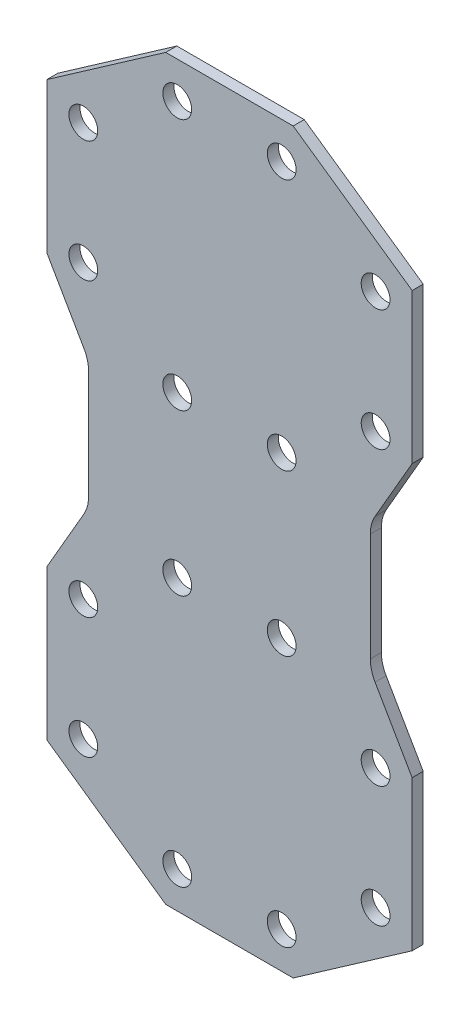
from build123d import *

# Parameters (mm, degrees)
MAIN_PLATE_DEPTH   = 31.75
SKETCH5_R          = 41.275
CUT_EXTRUDE1_DEPTH = 31.75


with BuildPart() as part:
    # Sketch3 → Main Plate (new body)
    with BuildSketch(Plane(origin=(0, 0, 0), x_dir=(0, 1, 0), z_dir=(0, 0, 1))):
        with BuildLine():
            Line((201.663107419, -523.855268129), (-228.234235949, -523.855268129))
            Line((-228.234235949, -523.855268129), (-466.324268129, -182.70492307))
            Line((-466.324268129, -182.70492307), (-466.324268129, 182.70492307))
            Line((-466.324268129, 182.70492307), (-228.234235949, 523.855268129))
            Line((-228.234235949, 523.855268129), (201.663107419, 523.855268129))
            Line((201.663107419, 523.855268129), (385.932842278, 417.467087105))
            ThreePointArc((385.932842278, 417.467087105), (410.436827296, 407.317204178), (436.732842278, 403.855268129))
            Line((436.732842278, 403.855268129), (746.653157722, 403.855268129))
            ThreePointArc((746.653157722, 403.855268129), (772.949172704, 407.317204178), (797.453157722, 417.467087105))
            Line((797.453157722, 417.467087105), (981.722892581, 523.855268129))
            Line((981.722892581, 523.855268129), (1411.620235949, 523.855268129))
            Line((1411.620235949, 523.855268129), (1649.710268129, 182.70492307))
            Line((1649.710268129, 182.70492307), (1649.710268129, -182.70492307))
            Line((1649.710268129, -182.70492307), (1411.620235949, -523.855268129))
            Line((1411.620235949, -523.855268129), (981.722892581, -523.855268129))
            Line((981.722892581, -523.855268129), (797.453157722, -417.467087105))
            ThreePointArc((797.453157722, -417.467087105), (772.949172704, -407.317204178), (746.653157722, -403.855268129))
            Line((746.653157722, -403.855268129), (436.732842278, -403.855268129))
            ThreePointArc((436.732842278, -403.855268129), (410.436827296, -407.317204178), (385.932842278, -417.467087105))
            Line((385.932842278, -417.467087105), (201.663107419, -523.855268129))
        make_face()
    extrude(amount=MAIN_PLATE_DEPTH)

    # Sketch5 → Cut-Extrude1 (cut)
    with BuildSketch(Plane(origin=(0, 0, 0), x_dir=(0, 1, 0), z_dir=(0, 0, 1))):
        with Locations(Location((-173.588730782, 419.080268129, 0), (0, 0, 270))):
            Circle(SKETCH5_R)
        with Locations(Location((173.588730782, 419.080268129, 0), (0, 0, 270))):
            Circle(SKETCH5_R)
        with Locations(Location((361.549268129, 149.758610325, 0), (0, 0, 270))):
            Circle(SKETCH5_R)
        with Locations(Location((361.549268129, -149.758610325, 0), (0, 0, 270))):
            Circle(SKETCH5_R)
        with Locations(Location((173.588730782, -419.080268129, 0), (0, 0, 270))):
            Circle(SKETCH5_R)
        with Locations(Location((-173.588730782, -419.080268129, 0), (0, 0, 270))):
            Circle(SKETCH5_R)
        with Locations(Location((-361.549268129, -149.758610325, 0), (0, 0, 270))):
            Circle(SKETCH5_R)
        with Locations(Location((-361.549268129, 149.758610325, 0), (0, 0, 270))):
            Circle(SKETCH5_R)
        with Locations(Location((821.836731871, -149.758610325, 0), (0, 0, 270))):
            Circle(SKETCH5_R)
        with Locations(Location((1009.797269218, 419.080268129, 0), (0, 0, 270))):
            Circle(SKETCH5_R)
        with Locations(Location((1544.935268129, -149.758610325, 0), (0, 0, 270))):
            Circle(SKETCH5_R)
        with Locations(Location((1356.974730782, -419.080268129, 0), (0, 0, 270))):
            Circle(SKETCH5_R)
        with Locations(Location((821.836731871, 149.758610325, 0), (0, 0, 270))):
            Circle(SKETCH5_R)
        with Locations(Location((1544.935268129, 149.758610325, 0), (0, 0, 270))):
            Circle(SKETCH5_R)
        with Locations(Location((1356.974730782, 419.080268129, 0), (0, 0, 270))):
            Circle(SKETCH5_R)
        with Locations(Location((1009.797269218, -419.080268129, 0), (0, 0, 270))):
            Circle(SKETCH5_R)
    extrude(amount=CUT_EXTRUDE1_DEPTH, mode=Mode.SUBTRACT)


solid = part.part
